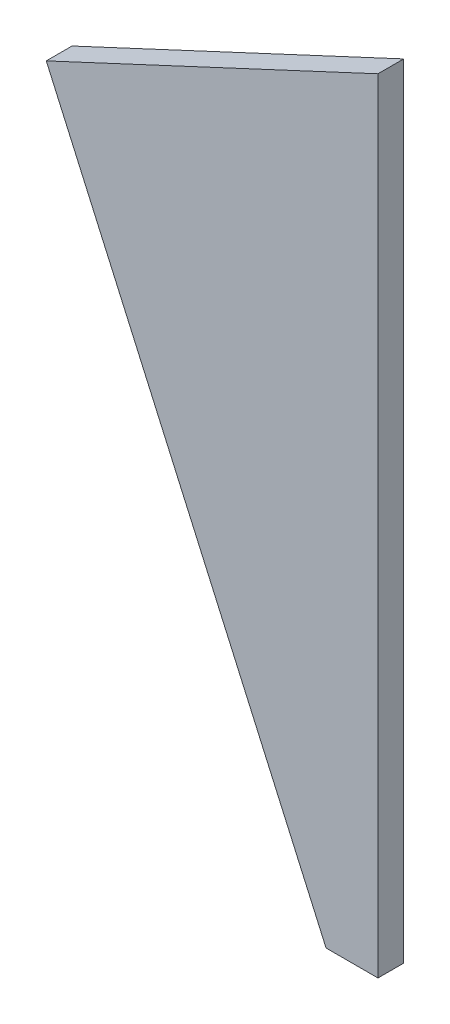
from build123d import *

# Parameters (mm, degrees)
BOSS_EXTRUDE1_DEPTH = 3.175


with BuildPart() as part:
    # Sketch1 → Boss-Extrude1 (new body)
    with BuildSketch(Plane.XY):
        Polygon((-40.882580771, 92.004985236), (-6.396885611, 14.548845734), (0, 14.548845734), (0, 111.068845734), align=None)
    extrude(amount=-BOSS_EXTRUDE1_DEPTH)


solid = part.part
